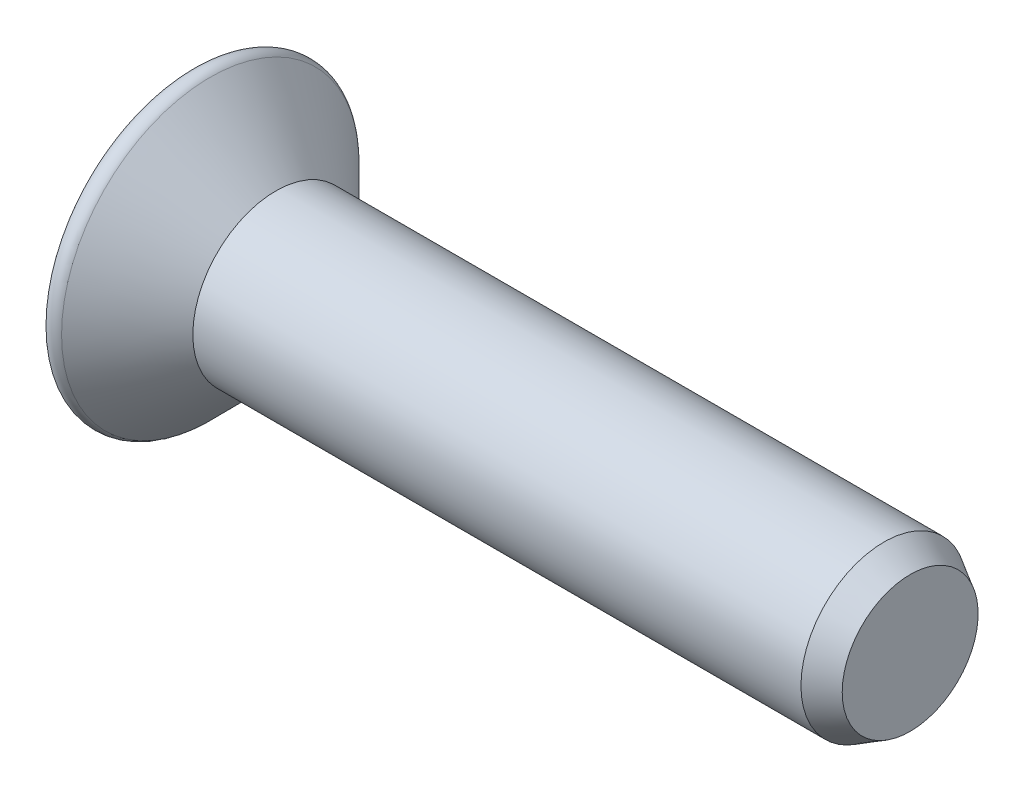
from build123d import *

# Parameters (mm, degrees)
CHAMFER1_SIZE      = 0.2
CHAMFER1_SIZE2     = 0.346410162
CUT_EXTRUDE1_DEPTH = 0.8
CUT_EXTRUDE1_TAPER = 6


with BuildPart() as part:
    # Sketch1 → Revolve1 (revolve)
    with BuildSketch(Plane.XY, mode=Mode.PRIVATE) as revolve1_sk:
        with BuildLine():
            Line((-1.6, 0), (8.4, 0))
            Line((8.4, 0), (8.4, 1.1))
            Line((8.4, 1.1), (0, 1.1))
            Line((0, 1.1), (-0.869043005, 1.969043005))
            ThreePointArc((-0.869043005, 1.969043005), (-0.992640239, 2.010371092), (-1.1, 1.936491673))
            ThreePointArc((-1.1, 1.936491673), (-1.472983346, 1), (-1.6, 0))
        make_face()
    revolve(revolve1_sk.sketch.rotate(Axis((0, 0, 0), (1, 0, 0)), 90), axis=Axis((0, 0, 0), (1, 0, 0)))

    # Chamfer1
    chamfer1_edges = [part.edges().sort_by_distance(p)[0] for p in [
        (8.4, 0, -1.1),
    ]]
    chamfer1_side = [part.faces().sort_by_distance(p)[0] for p in [
        (8.4, 0, 0),
    ]]
    chamfer(chamfer1_edges, length=CHAMFER1_SIZE, length2=CHAMFER1_SIZE2, reference=chamfer1_side[0])

    # Sketch3 → Cut-Extrude1 (cut)
    with BuildSketch(Plane(origin=(-1.6, 0, 0), x_dir=(0, 0, -1), z_dir=(1, 0, 0))):
        Polygon((-0.22, 1.1), (-0.146666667, 0.733333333), (-0.36140157, 0.36140157), (-0.733333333, 0.146666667), (-1.1, 0.22), (-1.1, -0.22), (-0.733333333, -0.146666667), (-0.36140157, -0.36140157), (-0.146666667, -0.733333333), (-0.22, -1.1), (0.22, -1.1), (0.146666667, -0.733333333), (0.36140157, -0.36140157), (0.733333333, -0.146666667), (1.1, -0.22), (1.1, 0.22), (0.733333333, 0.146666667), (0.36140157, 0.36140157), (0.146666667, 0.733333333), (0.22, 1.1), align=None)
    extrude(amount=CUT_EXTRUDE1_DEPTH, taper=CUT_EXTRUDE1_TAPER, mode=Mode.SUBTRACT)


solid = part.part
